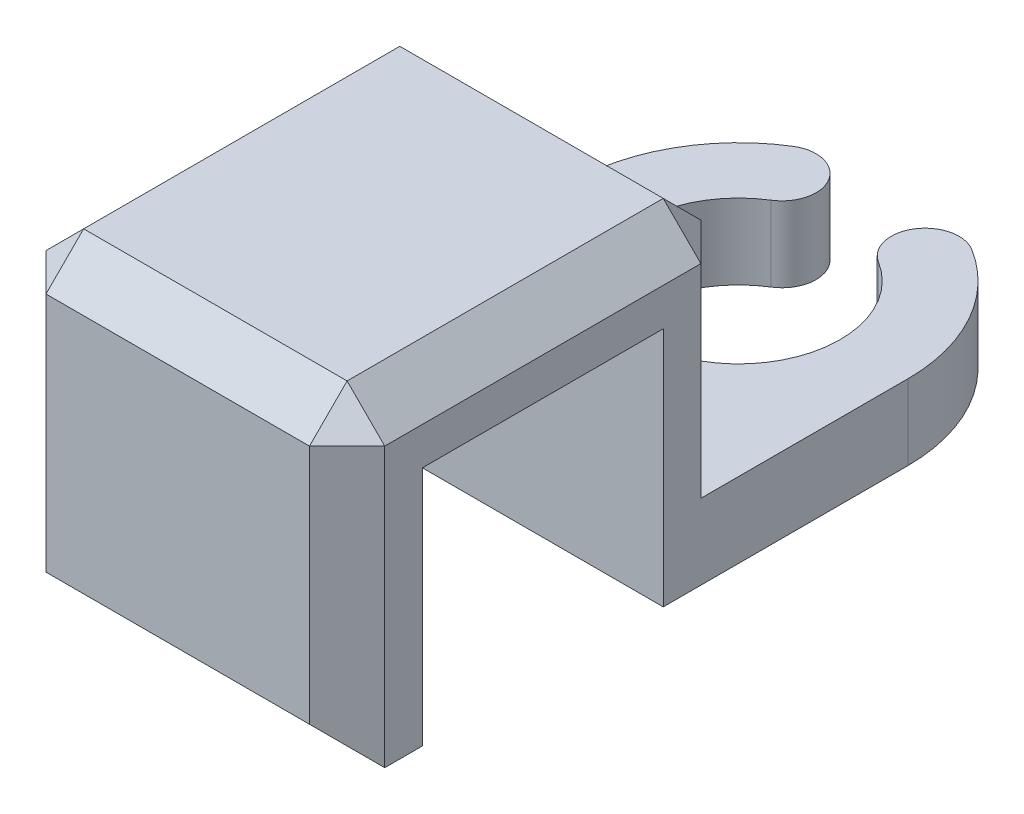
ISO-10303-21;
HEADER;
FILE_DESCRIPTION(('STEP AP214'),'2;1');
FILE_NAME('part.step','',(''),(''),'','','');
FILE_SCHEMA(('AUTOMOTIVE_DESIGN { 1 0 10303 214 1 1 1 1 }'));
ENDSEC;
DATA;
#1=APPLICATION_CONTEXT('core data for automotive mechanical design processes');
#2=APPLICATION_PROTOCOL_DEFINITION('international standard','automotive_design',2000,#1);
#3=PRODUCT_CONTEXT('',#1,'mechanical');
#4=PRODUCT('Part','Part','',(#3));
#5=PRODUCT_RELATED_PRODUCT_CATEGORY('part','',(#4));
#6=PRODUCT_DEFINITION_FORMATION('','',#4);
#7=PRODUCT_DEFINITION_CONTEXT('part definition',#1,'design');
#8=PRODUCT_DEFINITION('design','',#6,#7);
#9=PRODUCT_DEFINITION_SHAPE('','',#8);
#10=(LENGTH_UNIT() NAMED_UNIT(*) SI_UNIT(.MILLI.,.METRE.));
#11=(NAMED_UNIT(*) PLANE_ANGLE_UNIT() SI_UNIT($,.RADIAN.));
#12=(NAMED_UNIT(*) SI_UNIT($,.STERADIAN.) SOLID_ANGLE_UNIT());
#13=UNCERTAINTY_MEASURE_WITH_UNIT(LENGTH_MEASURE(1.E-05),#10,'distance_accuracy_value','');
#14=(GEOMETRIC_REPRESENTATION_CONTEXT(3) GLOBAL_UNCERTAINTY_ASSIGNED_CONTEXT((#13)) GLOBAL_UNIT_ASSIGNED_CONTEXT((#10,
#11,#12)) REPRESENTATION_CONTEXT('',''));
#15=CARTESIAN_POINT('',(0.,0.,0.));
#16=DIRECTION('',(0.,0.,1.));
#17=DIRECTION('',(1.,0.,0.));
#18=AXIS2_PLACEMENT_3D('',#15,#16,#17);
#19=CARTESIAN_POINT('',(-22.5,10.,0.));
#20=DIRECTION('',(1.,0.,0.));
#21=DIRECTION('',(0.,0.,-1.));
#22=AXIS2_PLACEMENT_3D('',#19,#20,#21);
#23=PLANE('',#22);
#24=DIRECTION('',(0.,0.,-1.));
#25=VECTOR('',#24,1.);
#26=CARTESIAN_POINT('',(-22.5,0.,74.5));
#27=LINE('',#26,#25);
#28=CARTESIAN_POINT('',(-22.5,0.,69.5));
#29=VERTEX_POINT('',#28);
#30=CARTESIAN_POINT('',(-22.5,0.,64.5));
#31=VERTEX_POINT('',#30);
#32=EDGE_CURVE('E170',#29,#31,#27,.T.);
#33=ORIENTED_EDGE('',*,*,#32,.F.);
#34=DIRECTION('',(0.,1.,0.));
#35=VECTOR('',#34,1.);
#36=CARTESIAN_POINT('',(-22.5,42.,69.5));
#37=LINE('',#36,#35);
#38=CARTESIAN_POINT('',(-22.5,37.,69.5));
#39=VERTEX_POINT('',#38);
#40=EDGE_CURVE('E330',#29,#39,#37,.T.);
#41=ORIENTED_EDGE('',*,*,#40,.T.);
#42=DIRECTION('',(0.,0.,-1.));
#43=VECTOR('',#42,1.);
#44=CARTESIAN_POINT('',(-22.5,37.,22.5));
#45=LINE('',#44,#43);
#46=CARTESIAN_POINT('',(-22.5,37.,27.5));
#47=VERTEX_POINT('',#46);
#48=EDGE_CURVE('E280',#39,#47,#45,.T.);
#49=ORIENTED_EDGE('',*,*,#48,.T.);
#50=DIRECTION('',(0.,-1.,0.));
#51=VECTOR('',#50,1.);
#52=CARTESIAN_POINT('',(-22.5,9.99999999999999,27.5));
#53=LINE('',#52,#51);
#54=CARTESIAN_POINT('',(-22.5,10.,27.5));
#55=VERTEX_POINT('',#54);
#56=EDGE_CURVE('E308',#47,#55,#53,.T.);
#57=ORIENTED_EDGE('',*,*,#56,.T.);
#58=DIRECTION('',(0.,0.,1.));
#59=VECTOR('',#58,1.);
#60=CARTESIAN_POINT('',(-22.5,10.,0.));
#61=LINE('',#60,#59);
#62=CARTESIAN_POINT('',(-22.5,10.,0.));
#63=VERTEX_POINT('',#62);
#64=EDGE_CURVE('E225',#63,#55,#61,.T.);
#65=ORIENTED_EDGE('',*,*,#64,.F.);
#66=DIRECTION('',(0.,-1.,0.));
#67=VECTOR('',#66,1.);
#68=CARTESIAN_POINT('',(-22.5,10.,0.));
#69=LINE('',#68,#67);
#70=CARTESIAN_POINT('',(-22.5,0.,0.));
#71=VERTEX_POINT('',#70);
#72=EDGE_CURVE('E649',#63,#71,#69,.T.);
#73=ORIENTED_EDGE('',*,*,#72,.T.);
#74=DIRECTION('',(0.,0.,1.));
#75=VECTOR('',#74,1.);
#76=CARTESIAN_POINT('',(-22.5,0.,0.));
#77=LINE('',#76,#75);
#78=CARTESIAN_POINT('',(-22.5,0.,32.5));
#79=VERTEX_POINT('',#78);
#80=EDGE_CURVE('E211',#71,#79,#77,.T.);
#81=ORIENTED_EDGE('',*,*,#80,.T.);
#82=DIRECTION('',(0.,-1.,0.));
#83=VECTOR('',#82,1.);
#84=CARTESIAN_POINT('',(-22.5,32.,32.5));
#85=LINE('',#84,#83);
#86=CARTESIAN_POINT('',(-22.5,32.,32.5));
#87=VERTEX_POINT('',#86);
#88=EDGE_CURVE('E189',#87,#79,#85,.T.);
#89=ORIENTED_EDGE('',*,*,#88,.F.);
#90=DIRECTION('',(0.,0.,-1.));
#91=VECTOR('',#90,1.);
#92=CARTESIAN_POINT('',(-22.5,32.,64.5));
#93=LINE('',#92,#91);
#94=CARTESIAN_POINT('',(-22.5,32.,64.5));
#95=VERTEX_POINT('',#94);
#96=EDGE_CURVE('E194',#95,#87,#93,.T.);
#97=ORIENTED_EDGE('',*,*,#96,.F.);
#98=DIRECTION('',(0.,1.,0.));
#99=VECTOR('',#98,1.);
#100=CARTESIAN_POINT('',(-22.5,0.,64.5));
#101=LINE('',#100,#99);
#102=EDGE_CURVE('E180',#31,#95,#101,.T.);
#103=ORIENTED_EDGE('',*,*,#102,.F.);
#104=EDGE_LOOP('',(#33,#41,#49,#57,#65,#73,#81,#89,#97,#103));
#105=FACE_BOUND('',#104,.T.);
#106=ADVANCED_FACE('F31',(#105),#23,.F.);
#107=CARTESIAN_POINT('',(22.5,10.,0.));
#108=DIRECTION('',(-1.,0.,0.));
#109=DIRECTION('',(0.,0.,1.));
#110=AXIS2_PLACEMENT_3D('',#107,#108,#109);
#111=PLANE('',#110);
#112=DIRECTION('',(0.,0.,1.));
#113=VECTOR('',#112,1.);
#114=CARTESIAN_POINT('',(22.5,37.,74.5));
#115=LINE('',#114,#113);
#116=CARTESIAN_POINT('',(22.5,37.,27.5));
#117=VERTEX_POINT('',#116);
#118=CARTESIAN_POINT('',(22.5,37.,69.5));
#119=VERTEX_POINT('',#118);
#120=EDGE_CURVE('E294',#117,#119,#115,.T.);
#121=ORIENTED_EDGE('',*,*,#120,.T.);
#122=DIRECTION('',(0.,-1.,0.));
#123=VECTOR('',#122,1.);
#124=CARTESIAN_POINT('',(22.5,0.,69.5));
#125=LINE('',#124,#123);
#126=CARTESIAN_POINT('',(22.5,0.,69.5));
#127=VERTEX_POINT('',#126);
#128=EDGE_CURVE('E226',#119,#127,#125,.T.);
#129=ORIENTED_EDGE('',*,*,#128,.T.);
#130=DIRECTION('',(0.,0.,-1.));
#131=VECTOR('',#130,1.);
#132=CARTESIAN_POINT('',(22.5,0.,74.5));
#133=LINE('',#132,#131);
#134=CARTESIAN_POINT('',(22.5,0.,64.5));
#135=VERTEX_POINT('',#134);
#136=EDGE_CURVE('E200',#127,#135,#133,.T.);
#137=ORIENTED_EDGE('',*,*,#136,.T.);
#138=DIRECTION('',(0.,1.,0.));
#139=VECTOR('',#138,1.);
#140=CARTESIAN_POINT('',(22.5,0.,64.5));
#141=LINE('',#140,#139);
#142=CARTESIAN_POINT('',(22.5,32.,64.5));
#143=VERTEX_POINT('',#142);
#144=EDGE_CURVE('E187',#135,#143,#141,.T.);
#145=ORIENTED_EDGE('',*,*,#144,.T.);
#146=DIRECTION('',(0.,0.,-1.));
#147=VECTOR('',#146,1.);
#148=CARTESIAN_POINT('',(22.5,32.,64.5));
#149=LINE('',#148,#147);
#150=CARTESIAN_POINT('',(22.5,32.,32.5));
#151=VERTEX_POINT('',#150);
#152=EDGE_CURVE('E203',#143,#151,#149,.T.);
#153=ORIENTED_EDGE('',*,*,#152,.T.);
#154=DIRECTION('',(0.,-1.,0.));
#155=VECTOR('',#154,1.);
#156=CARTESIAN_POINT('',(22.5,32.,32.5));
#157=LINE('',#156,#155);
#158=CARTESIAN_POINT('',(22.5,0.,32.5));
#159=VERTEX_POINT('',#158);
#160=EDGE_CURVE('E181',#151,#159,#157,.T.);
#161=ORIENTED_EDGE('',*,*,#160,.T.);
#162=DIRECTION('',(0.,0.,-1.));
#163=VECTOR('',#162,1.);
#164=CARTESIAN_POINT('',(22.5,0.,0.));
#165=LINE('',#164,#163);
#166=CARTESIAN_POINT('',(22.5,0.,0.));
#167=VERTEX_POINT('',#166);
#168=EDGE_CURVE('E630',#159,#167,#165,.T.);
#169=ORIENTED_EDGE('',*,*,#168,.T.);
#170=DIRECTION('',(0.,-1.,0.));
#171=VECTOR('',#170,1.);
#172=CARTESIAN_POINT('',(22.5,10.,0.));
#173=LINE('',#172,#171);
#174=CARTESIAN_POINT('',(22.5,10.,0.));
#175=VERTEX_POINT('',#174);
#176=EDGE_CURVE('E318',#175,#167,#173,.T.);
#177=ORIENTED_EDGE('',*,*,#176,.F.);
#178=DIRECTION('',(0.,0.,-1.));
#179=VECTOR('',#178,1.);
#180=CARTESIAN_POINT('',(22.5,10.,0.));
#181=LINE('',#180,#179);
#182=CARTESIAN_POINT('',(22.5,10.,27.5));
#183=VERTEX_POINT('',#182);
#184=EDGE_CURVE('E224',#183,#175,#181,.T.);
#185=ORIENTED_EDGE('',*,*,#184,.F.);
#186=DIRECTION('',(0.,1.,0.));
#187=VECTOR('',#186,1.);
#188=CARTESIAN_POINT('',(22.5,42.,27.5));
#189=LINE('',#188,#187);
#190=EDGE_CURVE('E288',#183,#117,#189,.T.);
#191=ORIENTED_EDGE('',*,*,#190,.T.);
#192=EDGE_LOOP('',(#121,#129,#137,#145,#153,#161,#169,#177,#185,#191));
#193=FACE_BOUND('',#192,.T.);
#194=ADVANCED_FACE('F299',(#193),#111,.F.);
#195=CARTESIAN_POINT('',(0.,10.,0.));
#196=DIRECTION('',(0.,-1.,0.));
#197=DIRECTION('',(0.,0.,-1.));
#198=AXIS2_PLACEMENT_3D('',#195,#196,#197);
#199=CYLINDRICAL_SURFACE('',#198,22.5);
#200=CARTESIAN_POINT('',(0.,0.,0.));
#201=DIRECTION('',(0.,1.,0.));
#202=DIRECTION('',(0.,0.,1.));
#203=AXIS2_PLACEMENT_3D('',#200,#201,#202);
#204=CIRCLE('',#203,22.5);
#205=CARTESIAN_POINT('',(11.875,0.,-19.1111060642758));
#206=VERTEX_POINT('',#205);
#207=EDGE_CURVE('E622',#167,#206,#204,.T.);
#208=ORIENTED_EDGE('',*,*,#207,.T.);
#209=DIRECTION('',(0.,-1.,0.));
#210=VECTOR('',#209,1.);
#211=CARTESIAN_POINT('',(11.875,10.,-19.1111060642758));
#212=LINE('',#211,#210);
#213=CARTESIAN_POINT('',(11.875,10.,-19.1111060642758));
#214=VERTEX_POINT('',#213);
#215=EDGE_CURVE('E625',#214,#206,#212,.T.);
#216=ORIENTED_EDGE('',*,*,#215,.F.);
#217=CARTESIAN_POINT('',(0.,10.,0.));
#218=DIRECTION('',(0.,1.,0.));
#219=DIRECTION('',(0.,0.,1.));
#220=AXIS2_PLACEMENT_3D('',#217,#218,#219);
#221=CIRCLE('',#220,22.5);
#222=EDGE_CURVE('E217',#175,#214,#221,.T.);
#223=ORIENTED_EDGE('',*,*,#222,.F.);
#224=ORIENTED_EDGE('',*,*,#176,.T.);
#225=EDGE_LOOP('',(#208,#216,#223,#224));
#226=FACE_BOUND('',#225,.T.);
#227=ADVANCED_FACE('F378',(#226),#199,.T.);
#228=CARTESIAN_POINT('',(9.49999999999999,10.,-15.2888848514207));
#229=DIRECTION('',(0.,-1.,0.));
#230=DIRECTION('',(0.,0.,-1.));
#231=AXIS2_PLACEMENT_3D('',#228,#229,#230);
#232=CYLINDRICAL_SURFACE('',#231,4.49999999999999);
#233=CARTESIAN_POINT('',(9.49999999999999,0.,-15.2888848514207));
#234=DIRECTION('',(0.,1.,0.));
#235=DIRECTION('',(0.,0.,1.));
#236=AXIS2_PLACEMENT_3D('',#233,#234,#235);
#237=CIRCLE('',#236,4.49999999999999);
#238=CARTESIAN_POINT('',(7.12499999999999,0.,-11.4666636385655));
#239=VERTEX_POINT('',#238);
#240=EDGE_CURVE('E629',#206,#239,#237,.T.);
#241=ORIENTED_EDGE('',*,*,#240,.T.);
#242=DIRECTION('',(0.,-1.,0.));
#243=VECTOR('',#242,1.);
#244=CARTESIAN_POINT('',(7.12499999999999,10.,-11.4666636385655));
#245=LINE('',#244,#243);
#246=CARTESIAN_POINT('',(7.12499999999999,10.,-11.4666636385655));
#247=VERTEX_POINT('',#246);
#248=EDGE_CURVE('E635',#247,#239,#245,.T.);
#249=ORIENTED_EDGE('',*,*,#248,.F.);
#250=CARTESIAN_POINT('',(9.49999999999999,10.,-15.2888848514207));
#251=DIRECTION('',(0.,1.,0.));
#252=DIRECTION('',(0.,0.,1.));
#253=AXIS2_PLACEMENT_3D('',#250,#251,#252);
#254=CIRCLE('',#253,4.49999999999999);
#255=EDGE_CURVE('E634',#214,#247,#254,.T.);
#256=ORIENTED_EDGE('',*,*,#255,.F.);
#257=ORIENTED_EDGE('',*,*,#215,.T.);
#258=EDGE_LOOP('',(#241,#249,#256,#257));
#259=FACE_BOUND('',#258,.T.);
#260=ADVANCED_FACE('F597',(#259),#232,.T.);
#261=CARTESIAN_POINT('',(0.,10.,0.));
#262=DIRECTION('',(0.,-1.,0.));
#263=DIRECTION('',(0.,0.,-1.));
#264=AXIS2_PLACEMENT_3D('',#261,#262,#263);
#265=CYLINDRICAL_SURFACE('',#264,13.5);
#266=CARTESIAN_POINT('',(0.,0.,0.));
#267=DIRECTION('',(0.,-1.,0.));
#268=DIRECTION('',(0.,0.,1.));
#269=AXIS2_PLACEMENT_3D('',#266,#267,#268);
#270=CIRCLE('',#269,13.5);
#271=CARTESIAN_POINT('',(-7.125,0.,-11.4666636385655));
#272=VERTEX_POINT('',#271);
#273=EDGE_CURVE('E640',#239,#272,#270,.T.);
#274=ORIENTED_EDGE('',*,*,#273,.T.);
#275=DIRECTION('',(0.,-1.,0.));
#276=VECTOR('',#275,1.);
#277=CARTESIAN_POINT('',(-7.125,10.,-11.4666636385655));
#278=LINE('',#277,#276);
#279=CARTESIAN_POINT('',(-7.125,10.,-11.4666636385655));
#280=VERTEX_POINT('',#279);
#281=EDGE_CURVE('E655',#280,#272,#278,.T.);
#282=ORIENTED_EDGE('',*,*,#281,.F.);
#283=CARTESIAN_POINT('',(0.,10.,0.));
#284=DIRECTION('',(0.,-1.,0.));
#285=DIRECTION('',(0.,0.,1.));
#286=AXIS2_PLACEMENT_3D('',#283,#284,#285);
#287=CIRCLE('',#286,13.5);
#288=EDGE_CURVE('E665',#247,#280,#287,.T.);
#289=ORIENTED_EDGE('',*,*,#288,.F.);
#290=ORIENTED_EDGE('',*,*,#248,.T.);
#291=EDGE_LOOP('',(#274,#282,#289,#290));
#292=FACE_BOUND('',#291,.T.);
#293=ADVANCED_FACE('F588',(#292),#265,.F.);
#294=CARTESIAN_POINT('',(-9.5,10.,-15.2888848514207));
#295=DIRECTION('',(0.,-1.,0.));
#296=DIRECTION('',(0.,0.,-1.));
#297=AXIS2_PLACEMENT_3D('',#294,#295,#296);
#298=CYLINDRICAL_SURFACE('',#297,4.49999999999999);
#299=CARTESIAN_POINT('',(-9.5,0.,-15.2888848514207));
#300=DIRECTION('',(0.,1.,0.));
#301=DIRECTION('',(0.,0.,1.));
#302=AXIS2_PLACEMENT_3D('',#299,#300,#301);
#303=CIRCLE('',#302,4.49999999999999);
#304=CARTESIAN_POINT('',(-11.875,0.,-19.1111060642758));
#305=VERTEX_POINT('',#304);
#306=EDGE_CURVE('E642',#272,#305,#303,.T.);
#307=ORIENTED_EDGE('',*,*,#306,.T.);
#308=DIRECTION('',(0.,-1.,0.));
#309=VECTOR('',#308,1.);
#310=CARTESIAN_POINT('',(-11.875,10.,-19.1111060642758));
#311=LINE('',#310,#309);
#312=CARTESIAN_POINT('',(-11.875,10.,-19.1111060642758));
#313=VERTEX_POINT('',#312);
#314=EDGE_CURVE('E651',#313,#305,#311,.T.);
#315=ORIENTED_EDGE('',*,*,#314,.F.);
#316=CARTESIAN_POINT('',(-9.5,10.,-15.2888848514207));
#317=DIRECTION('',(0.,1.,0.));
#318=DIRECTION('',(0.,0.,1.));
#319=AXIS2_PLACEMENT_3D('',#316,#317,#318);
#320=CIRCLE('',#319,4.49999999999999);
#321=EDGE_CURVE('E666',#280,#313,#320,.T.);
#322=ORIENTED_EDGE('',*,*,#321,.F.);
#323=ORIENTED_EDGE('',*,*,#281,.T.);
#324=EDGE_LOOP('',(#307,#315,#322,#323));
#325=FACE_BOUND('',#324,.T.);
#326=ADVANCED_FACE('F579',(#325),#298,.T.);
#327=CARTESIAN_POINT('',(0.,10.,0.));
#328=DIRECTION('',(0.,-1.,0.));
#329=DIRECTION('',(0.,0.,-1.));
#330=AXIS2_PLACEMENT_3D('',#327,#328,#329);
#331=CYLINDRICAL_SURFACE('',#330,22.5);
#332=CARTESIAN_POINT('',(0.,0.,0.));
#333=DIRECTION('',(0.,1.,0.));
#334=DIRECTION('',(0.,0.,1.));
#335=AXIS2_PLACEMENT_3D('',#332,#333,#334);
#336=CIRCLE('',#335,22.5);
#337=EDGE_CURVE('E647',#305,#71,#336,.T.);
#338=ORIENTED_EDGE('',*,*,#337,.T.);
#339=ORIENTED_EDGE('',*,*,#72,.F.);
#340=CARTESIAN_POINT('',(0.,10.,0.));
#341=DIRECTION('',(0.,1.,0.));
#342=DIRECTION('',(0.,0.,1.));
#343=AXIS2_PLACEMENT_3D('',#340,#341,#342);
#344=CIRCLE('',#343,22.5);
#345=EDGE_CURVE('E652',#313,#63,#344,.T.);
#346=ORIENTED_EDGE('',*,*,#345,.F.);
#347=ORIENTED_EDGE('',*,*,#314,.T.);
#348=EDGE_LOOP('',(#338,#339,#346,#347));
#349=FACE_BOUND('',#348,.T.);
#350=ADVANCED_FACE('F553',(#349),#331,.T.);
#351=CARTESIAN_POINT('',(0.,10.,0.));
#352=DIRECTION('',(0.,1.,0.));
#353=DIRECTION('',(0.,0.,1.));
#354=AXIS2_PLACEMENT_3D('',#351,#352,#353);
#355=PLANE('',#354);
#356=ORIENTED_EDGE('',*,*,#64,.T.);
#357=DIRECTION('',(0.707106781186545,0.,-0.70710678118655));
#358=VECTOR('',#357,1.);
#359=CARTESIAN_POINT('',(-17.5,10.,22.5));
#360=LINE('',#359,#358);
#361=CARTESIAN_POINT('',(-17.5,10.,22.5));
#362=VERTEX_POINT('',#361);
#363=EDGE_CURVE('E40',#55,#362,#360,.T.);
#364=ORIENTED_EDGE('',*,*,#363,.T.);
#365=DIRECTION('',(1.,0.,0.));
#366=VECTOR('',#365,1.);
#367=CARTESIAN_POINT('',(22.5,10.,22.5));
#368=LINE('',#367,#366);
#369=CARTESIAN_POINT('',(17.5,10.,22.5));
#370=VERTEX_POINT('',#369);
#371=EDGE_CURVE('E220',#362,#370,#368,.T.);
#372=ORIENTED_EDGE('',*,*,#371,.T.);
#373=DIRECTION('',(0.707106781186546,0.,0.707106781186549));
#374=VECTOR('',#373,1.);
#375=CARTESIAN_POINT('',(22.5,10.,27.5));
#376=LINE('',#375,#374);
#377=EDGE_CURVE('E11',#370,#183,#376,.T.);
#378=ORIENTED_EDGE('',*,*,#377,.T.);
#379=ORIENTED_EDGE('',*,*,#184,.T.);
#380=ORIENTED_EDGE('',*,*,#222,.T.);
#381=ORIENTED_EDGE('',*,*,#255,.T.);
#382=ORIENTED_EDGE('',*,*,#288,.T.);
#383=ORIENTED_EDGE('',*,*,#321,.T.);
#384=ORIENTED_EDGE('',*,*,#345,.T.);
#385=EDGE_LOOP('',(#356,#364,#372,#378,#379,#380,#381,#382,#383,#384));
#386=FACE_BOUND('',#385,.T.);
#387=ADVANCED_FACE('F347',(#386),#355,.T.);
#388=CARTESIAN_POINT('',(0.,0.,0.));
#389=DIRECTION('',(0.,1.,0.));
#390=DIRECTION('',(0.,0.,1.));
#391=AXIS2_PLACEMENT_3D('',#388,#389,#390);
#392=PLANE('',#391);
#393=ORIENTED_EDGE('',*,*,#80,.F.);
#394=ORIENTED_EDGE('',*,*,#337,.F.);
#395=ORIENTED_EDGE('',*,*,#306,.F.);
#396=ORIENTED_EDGE('',*,*,#273,.F.);
#397=ORIENTED_EDGE('',*,*,#240,.F.);
#398=ORIENTED_EDGE('',*,*,#207,.F.);
#399=ORIENTED_EDGE('',*,*,#168,.F.);
#400=DIRECTION('',(1.,0.,0.));
#401=VECTOR('',#400,1.);
#402=CARTESIAN_POINT('',(-22.5,0.,32.5));
#403=LINE('',#402,#401);
#404=EDGE_CURVE('E208',#79,#159,#403,.T.);
#405=ORIENTED_EDGE('',*,*,#404,.F.);
#406=EDGE_LOOP('',(#393,#394,#395,#396,#397,#398,#399,#405));
#407=FACE_BOUND('',#406,.T.);
#408=ADVANCED_FACE('F519',(#407),#392,.F.);
#409=CARTESIAN_POINT('',(-22.5,0.,22.5));
#410=DIRECTION('',(0.,0.,-1.));
#411=DIRECTION('',(-1.,0.,0.));
#412=AXIS2_PLACEMENT_3D('',#409,#410,#411);
#413=PLANE('',#412);
#414=ORIENTED_EDGE('',*,*,#371,.F.);
#415=DIRECTION('',(0.,1.,0.));
#416=VECTOR('',#415,1.);
#417=CARTESIAN_POINT('',(-17.5,42.,22.5));
#418=LINE('',#417,#416);
#419=CARTESIAN_POINT('',(-17.5,37.,22.5));
#420=VERTEX_POINT('',#419);
#421=EDGE_CURVE('E53',#362,#420,#418,.T.);
#422=ORIENTED_EDGE('',*,*,#421,.T.);
#423=DIRECTION('',(1.,0.,0.));
#424=VECTOR('',#423,1.);
#425=CARTESIAN_POINT('',(-22.5,37.,22.5));
#426=LINE('',#425,#424);
#427=CARTESIAN_POINT('',(17.5,37.,22.5));
#428=VERTEX_POINT('',#427);
#429=EDGE_CURVE('E48',#420,#428,#426,.T.);
#430=ORIENTED_EDGE('',*,*,#429,.T.);
#431=DIRECTION('',(0.,-1.,0.));
#432=VECTOR('',#431,1.);
#433=CARTESIAN_POINT('',(17.5,9.99999999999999,22.5));
#434=LINE('',#433,#432);
#435=EDGE_CURVE('E229',#428,#370,#434,.T.);
#436=ORIENTED_EDGE('',*,*,#435,.T.);
#437=EDGE_LOOP('',(#414,#422,#430,#436));
#438=FACE_BOUND('',#437,.T.);
#439=ADVANCED_FACE('F345',(#438),#413,.T.);
#440=CARTESIAN_POINT('',(-22.5,32.,32.5));
#441=DIRECTION('',(0.,0.,1.));
#442=DIRECTION('',(1.,0.,0.));
#443=AXIS2_PLACEMENT_3D('',#440,#441,#442);
#444=PLANE('',#443);
#445=ORIENTED_EDGE('',*,*,#160,.F.);
#446=DIRECTION('',(1.,0.,0.));
#447=VECTOR('',#446,1.);
#448=CARTESIAN_POINT('',(-22.5,32.,32.5));
#449=LINE('',#448,#447);
#450=EDGE_CURVE('E212',#87,#151,#449,.T.);
#451=ORIENTED_EDGE('',*,*,#450,.F.);
#452=ORIENTED_EDGE('',*,*,#88,.T.);
#453=ORIENTED_EDGE('',*,*,#404,.T.);
#454=EDGE_LOOP('',(#445,#451,#452,#453));
#455=FACE_BOUND('',#454,.T.);
#456=ADVANCED_FACE('F502',(#455),#444,.T.);
#457=CARTESIAN_POINT('',(-22.5,32.,64.5));
#458=DIRECTION('',(0.,-1.,0.));
#459=DIRECTION('',(0.,0.,-1.));
#460=AXIS2_PLACEMENT_3D('',#457,#458,#459);
#461=PLANE('',#460);
#462=ORIENTED_EDGE('',*,*,#152,.F.);
#463=DIRECTION('',(1.,0.,0.));
#464=VECTOR('',#463,1.);
#465=CARTESIAN_POINT('',(-22.5,32.,64.5));
#466=LINE('',#465,#464);
#467=EDGE_CURVE('E188',#95,#143,#466,.T.);
#468=ORIENTED_EDGE('',*,*,#467,.F.);
#469=ORIENTED_EDGE('',*,*,#96,.T.);
#470=ORIENTED_EDGE('',*,*,#450,.T.);
#471=EDGE_LOOP('',(#462,#468,#469,#470));
#472=FACE_BOUND('',#471,.T.);
#473=ADVANCED_FACE('F494',(#472),#461,.T.);
#474=CARTESIAN_POINT('',(-22.5,0.,64.5));
#475=DIRECTION('',(0.,0.,-1.));
#476=DIRECTION('',(-1.,0.,0.));
#477=AXIS2_PLACEMENT_3D('',#474,#475,#476);
#478=PLANE('',#477);
#479=ORIENTED_EDGE('',*,*,#144,.F.);
#480=DIRECTION('',(1.,0.,0.));
#481=VECTOR('',#480,1.);
#482=CARTESIAN_POINT('',(-22.5,0.,64.5));
#483=LINE('',#482,#481);
#484=EDGE_CURVE('E174',#31,#135,#483,.T.);
#485=ORIENTED_EDGE('',*,*,#484,.F.);
#486=ORIENTED_EDGE('',*,*,#102,.T.);
#487=ORIENTED_EDGE('',*,*,#467,.T.);
#488=EDGE_LOOP('',(#479,#485,#486,#487));
#489=FACE_BOUND('',#488,.T.);
#490=ADVANCED_FACE('F185',(#489),#478,.T.);
#491=CARTESIAN_POINT('',(-22.5,0.,74.5));
#492=DIRECTION('',(0.,-1.,0.));
#493=DIRECTION('',(0.,0.,-1.));
#494=AXIS2_PLACEMENT_3D('',#491,#492,#493);
#495=PLANE('',#494);
#496=ORIENTED_EDGE('',*,*,#136,.F.);
#497=DIRECTION('',(-1.,0.,0.));
#498=VECTOR('',#497,1.);
#499=CARTESIAN_POINT('',(-22.5,0.,69.5));
#500=LINE('',#499,#498);
#501=EDGE_CURVE('E177',#127,#29,#500,.T.);
#502=ORIENTED_EDGE('',*,*,#501,.T.);
#503=ORIENTED_EDGE('',*,*,#32,.T.);
#504=ORIENTED_EDGE('',*,*,#484,.T.);
#505=EDGE_LOOP('',(#496,#502,#503,#504));
#506=FACE_BOUND('',#505,.T.);
#507=ADVANCED_FACE('F173',(#506),#495,.T.);
#508=CARTESIAN_POINT('',(-22.5,42.,74.5));
#509=DIRECTION('',(0.,0.,1.));
#510=DIRECTION('',(1.,0.,0.));
#511=AXIS2_PLACEMENT_3D('',#508,#509,#510);
#512=PLANE('',#511);
#513=DIRECTION('',(0.,-1.,0.));
#514=VECTOR('',#513,1.);
#515=CARTESIAN_POINT('',(-17.5,0.,74.5));
#516=LINE('',#515,#514);
#517=CARTESIAN_POINT('',(-17.5,37.,74.5));
#518=VERTEX_POINT('',#517);
#519=CARTESIAN_POINT('',(-17.5,5.,74.5));
#520=VERTEX_POINT('',#519);
#521=EDGE_CURVE('E322',#518,#520,#516,.T.);
#522=ORIENTED_EDGE('',*,*,#521,.T.);
#523=DIRECTION('',(1.,0.,0.));
#524=VECTOR('',#523,1.);
#525=CARTESIAN_POINT('',(-22.5,5.,74.5));
#526=LINE('',#525,#524);
#527=CARTESIAN_POINT('',(17.5,5.,74.5));
#528=VERTEX_POINT('',#527);
#529=EDGE_CURVE('E309',#520,#528,#526,.T.);
#530=ORIENTED_EDGE('',*,*,#529,.T.);
#531=DIRECTION('',(0.,1.,0.));
#532=VECTOR('',#531,1.);
#533=CARTESIAN_POINT('',(17.5,42.,74.5));
#534=LINE('',#533,#532);
#535=CARTESIAN_POINT('',(17.5,37.,74.5));
#536=VERTEX_POINT('',#535);
#537=EDGE_CURVE('E312',#528,#536,#534,.T.);
#538=ORIENTED_EDGE('',*,*,#537,.T.);
#539=DIRECTION('',(-1.,0.,0.));
#540=VECTOR('',#539,1.);
#541=CARTESIAN_POINT('',(-22.5,37.,74.5));
#542=LINE('',#541,#540);
#543=EDGE_CURVE('E317',#536,#518,#542,.T.);
#544=ORIENTED_EDGE('',*,*,#543,.T.);
#545=EDGE_LOOP('',(#522,#530,#538,#544));
#546=FACE_BOUND('',#545,.T.);
#547=ADVANCED_FACE('F320',(#546),#512,.T.);
#548=CARTESIAN_POINT('',(-22.5,42.,22.5));
#549=DIRECTION('',(0.,1.,0.));
#550=DIRECTION('',(0.,0.,1.));
#551=AXIS2_PLACEMENT_3D('',#548,#549,#550);
#552=PLANE('',#551);
#553=DIRECTION('',(0.,0.,1.));
#554=VECTOR('',#553,1.);
#555=CARTESIAN_POINT('',(-17.5,42.,74.5));
#556=LINE('',#555,#554);
#557=CARTESIAN_POINT('',(-17.5,42.,27.5));
#558=VERTEX_POINT('',#557);
#559=CARTESIAN_POINT('',(-17.5,42.,69.5));
#560=VERTEX_POINT('',#559);
#561=EDGE_CURVE('E281',#558,#560,#556,.T.);
#562=ORIENTED_EDGE('',*,*,#561,.T.);
#563=DIRECTION('',(1.,0.,0.));
#564=VECTOR('',#563,1.);
#565=CARTESIAN_POINT('',(-22.5,42.,69.5));
#566=LINE('',#565,#564);
#567=CARTESIAN_POINT('',(17.5,42.,69.5));
#568=VERTEX_POINT('',#567);
#569=EDGE_CURVE('E285',#560,#568,#566,.T.);
#570=ORIENTED_EDGE('',*,*,#569,.T.);
#571=DIRECTION('',(0.,0.,-1.));
#572=VECTOR('',#571,1.);
#573=CARTESIAN_POINT('',(17.5,42.,22.5));
#574=LINE('',#573,#572);
#575=CARTESIAN_POINT('',(17.5,42.,27.5));
#576=VERTEX_POINT('',#575);
#577=EDGE_CURVE('E286',#568,#576,#574,.T.);
#578=ORIENTED_EDGE('',*,*,#577,.T.);
#579=DIRECTION('',(-1.,0.,0.));
#580=VECTOR('',#579,1.);
#581=CARTESIAN_POINT('',(-22.5,42.,27.5));
#582=LINE('',#581,#580);
#583=EDGE_CURVE('E290',#576,#558,#582,.T.);
#584=ORIENTED_EDGE('',*,*,#583,.T.);
#585=EDGE_LOOP('',(#562,#570,#578,#584));
#586=FACE_BOUND('',#585,.T.);
#587=ADVANCED_FACE('F332',(#586),#552,.T.);
#588=CARTESIAN_POINT('',(-17.5,0.,22.5));
#589=DIRECTION('',(-0.70710678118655,0.,-0.707106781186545));
#590=DIRECTION('',(-0.707106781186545,0.,0.70710678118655));
#591=AXIS2_PLACEMENT_3D('',#588,#589,#590);
#592=PLANE('',#591);
#593=ORIENTED_EDGE('',*,*,#363,.F.);
#594=ORIENTED_EDGE('',*,*,#56,.F.);
#595=DIRECTION('',(-0.707106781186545,0.,0.70710678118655));
#596=VECTOR('',#595,1.);
#597=CARTESIAN_POINT('',(-22.5,37.,27.5));
#598=LINE('',#597,#596);
#599=EDGE_CURVE('E35',#420,#47,#598,.T.);
#600=ORIENTED_EDGE('',*,*,#599,.F.);
#601=ORIENTED_EDGE('',*,*,#421,.F.);
#602=EDGE_LOOP('',(#593,#594,#600,#601));
#603=FACE_BOUND('',#602,.T.);
#604=ADVANCED_FACE('F33',(#603),#592,.T.);
#605=CARTESIAN_POINT('',(-22.5,37.,22.5));
#606=DIRECTION('',(0.,-0.707106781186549,0.707106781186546));
#607=DIRECTION('',(0.,-0.707106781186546,-0.707106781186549));
#608=AXIS2_PLACEMENT_3D('',#605,#606,#607);
#609=PLANE('',#608);
#610=DIRECTION('',(0.,-0.707106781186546,-0.707106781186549));
#611=VECTOR('',#610,1.);
#612=CARTESIAN_POINT('',(17.5,42.,27.5));
#613=LINE('',#612,#611);
#614=EDGE_CURVE('E263',#428,#576,#613,.F.);
#615=ORIENTED_EDGE('',*,*,#614,.F.);
#616=ORIENTED_EDGE('',*,*,#429,.F.);
#617=DIRECTION('',(0.,0.707106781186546,0.707106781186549));
#618=VECTOR('',#617,1.);
#619=CARTESIAN_POINT('',(-17.5,39.5,25.));
#620=LINE('',#619,#618);
#621=EDGE_CURVE('E265',#558,#420,#620,.F.);
#622=ORIENTED_EDGE('',*,*,#621,.F.);
#623=ORIENTED_EDGE('',*,*,#583,.F.);
#624=EDGE_LOOP('',(#615,#616,#622,#623));
#625=FACE_BOUND('',#624,.T.);
#626=ADVANCED_FACE('F336',(#625),#609,.F.);
#627=CARTESIAN_POINT('',(22.5,10.,27.5));
#628=DIRECTION('',(0.707106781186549,0.,-0.707106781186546));
#629=DIRECTION('',(-0.707106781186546,0.,-0.707106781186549));
#630=AXIS2_PLACEMENT_3D('',#627,#628,#629);
#631=PLANE('',#630);
#632=ORIENTED_EDGE('',*,*,#377,.F.);
#633=ORIENTED_EDGE('',*,*,#435,.F.);
#634=DIRECTION('',(-0.707106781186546,0.,-0.707106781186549));
#635=VECTOR('',#634,1.);
#636=CARTESIAN_POINT('',(20.,37.,25.));
#637=LINE('',#636,#635);
#638=EDGE_CURVE('E260',#117,#428,#637,.T.);
#639=ORIENTED_EDGE('',*,*,#638,.F.);
#640=ORIENTED_EDGE('',*,*,#190,.F.);
#641=EDGE_LOOP('',(#632,#633,#639,#640));
#642=FACE_BOUND('',#641,.T.);
#643=ADVANCED_FACE('F344',(#642),#631,.T.);
#644=CARTESIAN_POINT('',(-22.5,37.,27.5));
#645=DIRECTION('',(-0.577350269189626,0.577350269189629,-0.577350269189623));
#646=DIRECTION('',(-0.707106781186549,-0.707106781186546,0.));
#647=AXIS2_PLACEMENT_3D('',#644,#645,#646);
#648=PLANE('',#647);
#649=ORIENTED_EDGE('',*,*,#621,.T.);
#650=ORIENTED_EDGE('',*,*,#599,.T.);
#651=DIRECTION('',(0.707106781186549,0.707106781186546,0.));
#652=VECTOR('',#651,1.);
#653=CARTESIAN_POINT('',(-22.5,37.,27.5));
#654=LINE('',#653,#652);
#655=EDGE_CURVE('E257',#558,#47,#654,.F.);
#656=ORIENTED_EDGE('',*,*,#655,.F.);
#657=EDGE_LOOP('',(#649,#650,#656));
#658=FACE_BOUND('',#657,.T.);
#659=ADVANCED_FACE('F272',(#658),#648,.T.);
#660=CARTESIAN_POINT('',(17.5,42.,27.5));
#661=DIRECTION('',(0.577350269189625,0.577350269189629,-0.577350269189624));
#662=DIRECTION('',(-0.70710678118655,0.707106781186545,0.));
#663=AXIS2_PLACEMENT_3D('',#660,#661,#662);
#664=PLANE('',#663);
#665=ORIENTED_EDGE('',*,*,#638,.T.);
#666=ORIENTED_EDGE('',*,*,#614,.T.);
#667=DIRECTION('',(0.707106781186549,-0.707106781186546,0.));
#668=VECTOR('',#667,1.);
#669=CARTESIAN_POINT('',(17.5,42.,27.5));
#670=LINE('',#669,#668);
#671=EDGE_CURVE('E254',#117,#576,#670,.F.);
#672=ORIENTED_EDGE('',*,*,#671,.F.);
#673=EDGE_LOOP('',(#665,#666,#672));
#674=FACE_BOUND('',#673,.T.);
#675=ADVANCED_FACE('F340',(#674),#664,.T.);
#676=CARTESIAN_POINT('',(-17.5,42.,22.5));
#677=DIRECTION('',(-0.707106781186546,0.707106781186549,0.));
#678=DIRECTION('',(-0.707106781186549,-0.707106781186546,0.));
#679=AXIS2_PLACEMENT_3D('',#676,#677,#678);
#680=PLANE('',#679);
#681=ORIENTED_EDGE('',*,*,#655,.T.);
#682=ORIENTED_EDGE('',*,*,#48,.F.);
#683=DIRECTION('',(-0.707106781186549,-0.707106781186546,0.));
#684=VECTOR('',#683,1.);
#685=CARTESIAN_POINT('',(-22.5,37.,69.5));
#686=LINE('',#685,#684);
#687=EDGE_CURVE('E251',#560,#39,#686,.T.);
#688=ORIENTED_EDGE('',*,*,#687,.F.);
#689=ORIENTED_EDGE('',*,*,#561,.F.);
#690=EDGE_LOOP('',(#681,#682,#688,#689));
#691=FACE_BOUND('',#690,.T.);
#692=ADVANCED_FACE('F278',(#691),#680,.T.);
#693=CARTESIAN_POINT('',(-22.5,42.,69.5));
#694=DIRECTION('',(0.,-0.707106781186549,-0.707106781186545));
#695=DIRECTION('',(0.,0.707106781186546,-0.70710678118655));
#696=AXIS2_PLACEMENT_3D('',#693,#694,#695);
#697=PLANE('',#696);
#698=DIRECTION('',(0.,0.707106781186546,-0.70710678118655));
#699=VECTOR('',#698,1.);
#700=CARTESIAN_POINT('',(17.5,42.,69.5));
#701=LINE('',#700,#699);
#702=EDGE_CURVE('E245',#568,#536,#701,.F.);
#703=ORIENTED_EDGE('',*,*,#702,.F.);
#704=ORIENTED_EDGE('',*,*,#569,.F.);
#705=DIRECTION('',(0.,-0.707106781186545,0.707106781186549));
#706=VECTOR('',#705,1.);
#707=CARTESIAN_POINT('',(-17.5,39.5,72.));
#708=LINE('',#707,#706);
#709=EDGE_CURVE('E248',#518,#560,#708,.F.);
#710=ORIENTED_EDGE('',*,*,#709,.F.);
#711=ORIENTED_EDGE('',*,*,#543,.F.);
#712=EDGE_LOOP('',(#703,#704,#710,#711));
#713=FACE_BOUND('',#712,.T.);
#714=ADVANCED_FACE('F359',(#713),#697,.F.);
#715=CARTESIAN_POINT('',(22.5,37.,0.));
#716=DIRECTION('',(0.707106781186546,0.707106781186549,0.));
#717=DIRECTION('',(-0.707106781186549,0.707106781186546,0.));
#718=AXIS2_PLACEMENT_3D('',#715,#716,#717);
#719=PLANE('',#718);
#720=ORIENTED_EDGE('',*,*,#671,.T.);
#721=ORIENTED_EDGE('',*,*,#577,.F.);
#722=DIRECTION('',(-0.707106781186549,0.707106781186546,0.));
#723=VECTOR('',#722,1.);
#724=CARTESIAN_POINT('',(17.5,42.,69.5));
#725=LINE('',#724,#723);
#726=EDGE_CURVE('E243',#119,#568,#725,.T.);
#727=ORIENTED_EDGE('',*,*,#726,.F.);
#728=ORIENTED_EDGE('',*,*,#120,.F.);
#729=EDGE_LOOP('',(#720,#721,#727,#728));
#730=FACE_BOUND('',#729,.T.);
#731=ADVANCED_FACE('F362',(#730),#719,.T.);
#732=CARTESIAN_POINT('',(-22.5,37.,69.5));
#733=DIRECTION('',(-0.577350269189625,0.57735026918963,0.577350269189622));
#734=DIRECTION('',(-0.70710678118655,-0.707106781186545,0.));
#735=AXIS2_PLACEMENT_3D('',#732,#733,#734);
#736=PLANE('',#735);
#737=ORIENTED_EDGE('',*,*,#709,.T.);
#738=ORIENTED_EDGE('',*,*,#687,.T.);
#739=DIRECTION('',(0.707106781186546,0.,0.707106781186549));
#740=VECTOR('',#739,1.);
#741=CARTESIAN_POINT('',(-22.5,37.,69.5));
#742=LINE('',#741,#740);
#743=EDGE_CURVE('E240',#518,#39,#742,.F.);
#744=ORIENTED_EDGE('',*,*,#743,.F.);
#745=EDGE_LOOP('',(#737,#738,#744));
#746=FACE_BOUND('',#745,.T.);
#747=ADVANCED_FACE('F355',(#746),#736,.T.);
#748=CARTESIAN_POINT('',(17.5,42.,69.5));
#749=DIRECTION('',(0.577350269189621,0.577350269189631,0.577350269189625));
#750=DIRECTION('',(0.,-0.707106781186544,0.707106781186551));
#751=AXIS2_PLACEMENT_3D('',#748,#749,#750);
#752=PLANE('',#751);
#753=ORIENTED_EDGE('',*,*,#726,.T.);
#754=ORIENTED_EDGE('',*,*,#702,.T.);
#755=DIRECTION('',(0.70710678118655,0.,-0.707106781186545));
#756=VECTOR('',#755,1.);
#757=CARTESIAN_POINT('',(20.,37.,72.));
#758=LINE('',#757,#756);
#759=EDGE_CURVE('E237',#119,#536,#758,.F.);
#760=ORIENTED_EDGE('',*,*,#759,.F.);
#761=EDGE_LOOP('',(#753,#754,#760));
#762=FACE_BOUND('',#761,.T.);
#763=ADVANCED_FACE('F363',(#762),#752,.T.);
#764=CARTESIAN_POINT('',(-17.5,42.,74.5));
#765=DIRECTION('',(-0.707106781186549,0.,0.707106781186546));
#766=DIRECTION('',(0.707106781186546,0.,0.707106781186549));
#767=AXIS2_PLACEMENT_3D('',#764,#765,#766);
#768=PLANE('',#767);
#769=ORIENTED_EDGE('',*,*,#743,.T.);
#770=ORIENTED_EDGE('',*,*,#40,.F.);
#771=DIRECTION('',(-0.577350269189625,-0.577350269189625,-0.577350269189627));
#772=VECTOR('',#771,1.);
#773=CARTESIAN_POINT('',(-5.16666666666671,17.3333333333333,86.8333333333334));
#774=LINE('',#773,#772);
#775=EDGE_CURVE('E235',#520,#29,#774,.T.);
#776=ORIENTED_EDGE('',*,*,#775,.F.);
#777=ORIENTED_EDGE('',*,*,#521,.F.);
#778=EDGE_LOOP('',(#769,#770,#776,#777));
#779=FACE_BOUND('',#778,.T.);
#780=ADVANCED_FACE('F352',(#779),#768,.T.);
#781=CARTESIAN_POINT('',(22.5,10.,69.5));
#782=DIRECTION('',(0.707106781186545,0.,0.70710678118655));
#783=DIRECTION('',(0.70710678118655,0.,-0.707106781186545));
#784=AXIS2_PLACEMENT_3D('',#781,#782,#783);
#785=PLANE('',#784);
#786=ORIENTED_EDGE('',*,*,#759,.T.);
#787=ORIENTED_EDGE('',*,*,#537,.F.);
#788=DIRECTION('',(-0.57735026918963,0.577350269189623,0.577350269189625));
#789=VECTOR('',#788,1.);
#790=CARTESIAN_POINT('',(19.1666666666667,3.33333333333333,72.8333333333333));
#791=LINE('',#790,#789);
#792=EDGE_CURVE('E233',#127,#528,#791,.T.);
#793=ORIENTED_EDGE('',*,*,#792,.F.);
#794=ORIENTED_EDGE('',*,*,#128,.F.);
#795=EDGE_LOOP('',(#786,#787,#793,#794));
#796=FACE_BOUND('',#795,.T.);
#797=ADVANCED_FACE('F311',(#796),#785,.T.);
#798=CARTESIAN_POINT('',(-22.5,5.,74.5));
#799=DIRECTION('',(0.,0.707106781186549,-0.707106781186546));
#800=DIRECTION('',(0.,0.707106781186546,0.707106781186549));
#801=AXIS2_PLACEMENT_3D('',#798,#799,#800);
#802=PLANE('',#801);
#803=ORIENTED_EDGE('',*,*,#775,.T.);
#804=ORIENTED_EDGE('',*,*,#501,.F.);
#805=ORIENTED_EDGE('',*,*,#792,.T.);
#806=ORIENTED_EDGE('',*,*,#529,.F.);
#807=EDGE_LOOP('',(#803,#804,#805,#806));
#808=FACE_BOUND('',#807,.T.);
#809=ADVANCED_FACE('F303',(#808),#802,.F.);
#810=CLOSED_SHELL('',(#106,#194,#227,#260,#293,#326,#350,#387,#408,#439,#456,#473,#490,#507,
#547,#587,#604,#626,#643,#659,#675,#692,#714,#731,#747,#763,#780,#797,#809));
#811=MANIFOLD_SOLID_BREP('B2',#810);
#812=ADVANCED_BREP_SHAPE_REPRESENTATION('',(#18,#811),#14);
#813=SHAPE_DEFINITION_REPRESENTATION(#9,#812);
ENDSEC;
END-ISO-10303-21;
